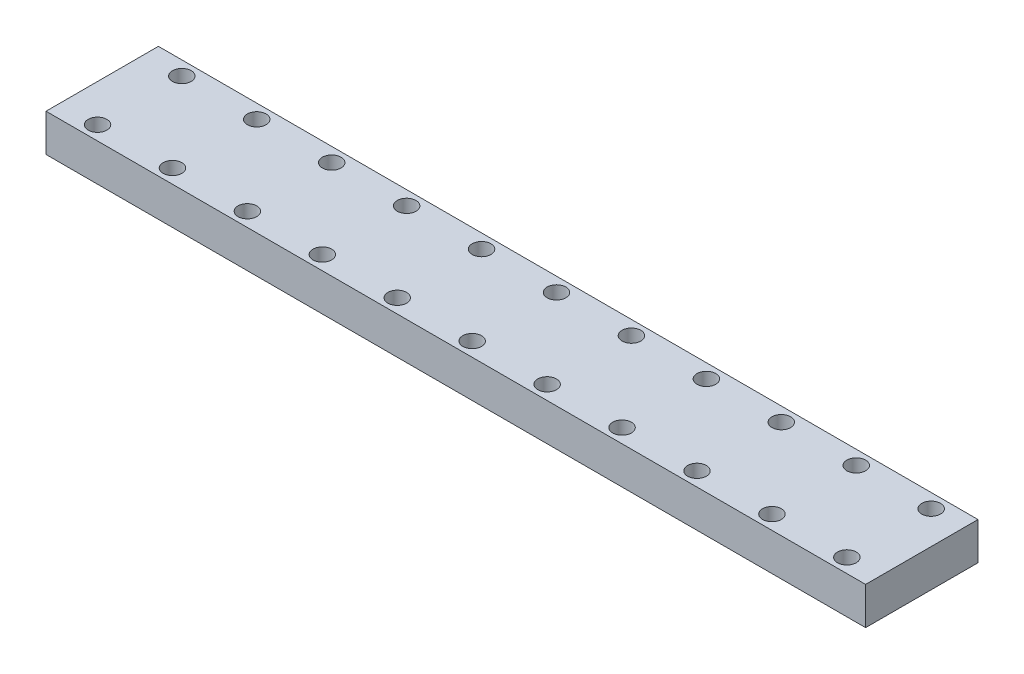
ISO-10303-21;
HEADER;
FILE_DESCRIPTION(('STEP AP214'),'2;1');
FILE_NAME('part.step','',(''),(''),'','','');
FILE_SCHEMA(('AUTOMOTIVE_DESIGN { 1 0 10303 214 1 1 1 1 }'));
ENDSEC;
DATA;
#1=APPLICATION_CONTEXT('core data for automotive mechanical design processes');
#2=APPLICATION_PROTOCOL_DEFINITION('international standard','automotive_design',2000,#1);
#3=PRODUCT_CONTEXT('',#1,'mechanical');
#4=PRODUCT('Part','Part','',(#3));
#5=PRODUCT_RELATED_PRODUCT_CATEGORY('part','',(#4));
#6=PRODUCT_DEFINITION_FORMATION('','',#4);
#7=PRODUCT_DEFINITION_CONTEXT('part definition',#1,'design');
#8=PRODUCT_DEFINITION('design','',#6,#7);
#9=PRODUCT_DEFINITION_SHAPE('','',#8);
#10=(LENGTH_UNIT() NAMED_UNIT(*) SI_UNIT(.MILLI.,.METRE.));
#11=(NAMED_UNIT(*) PLANE_ANGLE_UNIT() SI_UNIT($,.RADIAN.));
#12=(NAMED_UNIT(*) SI_UNIT($,.STERADIAN.) SOLID_ANGLE_UNIT());
#13=UNCERTAINTY_MEASURE_WITH_UNIT(LENGTH_MEASURE(1.E-05),#10,'distance_accuracy_value','');
#14=(GEOMETRIC_REPRESENTATION_CONTEXT(3) GLOBAL_UNCERTAINTY_ASSIGNED_CONTEXT((#13)) GLOBAL_UNIT_ASSIGNED_CONTEXT((#10,
#11,#12)) REPRESENTATION_CONTEXT('',''));
#15=CARTESIAN_POINT('',(0.,0.,0.));
#16=DIRECTION('',(0.,0.,1.));
#17=DIRECTION('',(1.,0.,0.));
#18=AXIS2_PLACEMENT_3D('',#15,#16,#17);
#19=CARTESIAN_POINT('',(0.,8.,0.));
#20=DIRECTION('',(0.,1.,0.));
#21=DIRECTION('',(0.,0.,1.));
#22=AXIS2_PLACEMENT_3D('',#19,#20,#21);
#23=PLANE('',#22);
#24=CARTESIAN_POINT('',(134.023529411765,8.,13.6117647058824));
#25=DIRECTION('',(0.,1.,0.));
#26=DIRECTION('',(0.,0.,1.));
#27=AXIS2_PLACEMENT_3D('',#24,#25,#26);
#28=CIRCLE('',#27,2.);
#29=CARTESIAN_POINT('',(134.023529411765,8.,15.6117647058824));
#30=VERTEX_POINT('',#29);
#31=EDGE_CURVE('E231',#30,#30,#28,.T.);
#32=ORIENTED_EDGE('',*,*,#31,.F.);
#33=EDGE_LOOP('',(#32));
#34=FACE_BOUND('',#33,.T.);
#35=CARTESIAN_POINT('',(102.023529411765,8.,13.6117647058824));
#36=DIRECTION('',(0.,1.,0.));
#37=DIRECTION('',(0.,0.,1.));
#38=AXIS2_PLACEMENT_3D('',#35,#36,#37);
#39=CIRCLE('',#38,2.);
#40=CARTESIAN_POINT('',(102.023529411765,8.,15.6117647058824));
#41=VERTEX_POINT('',#40);
#42=EDGE_CURVE('E219',#41,#41,#39,.T.);
#43=ORIENTED_EDGE('',*,*,#42,.F.);
#44=EDGE_LOOP('',(#43));
#45=FACE_BOUND('',#44,.T.);
#46=CARTESIAN_POINT('',(70.0235294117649,8.,13.6117647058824));
#47=DIRECTION('',(0.,1.,0.));
#48=DIRECTION('',(0.,0.,1.));
#49=AXIS2_PLACEMENT_3D('',#46,#47,#48);
#50=CIRCLE('',#49,2.);
#51=CARTESIAN_POINT('',(70.0235294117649,8.,15.6117647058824));
#52=VERTEX_POINT('',#51);
#53=EDGE_CURVE('E207',#52,#52,#50,.T.);
#54=ORIENTED_EDGE('',*,*,#53,.F.);
#55=EDGE_LOOP('',(#54));
#56=FACE_BOUND('',#55,.T.);
#57=CARTESIAN_POINT('',(38.0235294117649,8.,13.6117647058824));
#58=DIRECTION('',(0.,1.,0.));
#59=DIRECTION('',(0.,0.,1.));
#60=AXIS2_PLACEMENT_3D('',#57,#58,#59);
#61=CIRCLE('',#60,2.);
#62=CARTESIAN_POINT('',(38.0235294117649,8.,15.6117647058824));
#63=VERTEX_POINT('',#62);
#64=EDGE_CURVE('E195',#63,#63,#61,.T.);
#65=ORIENTED_EDGE('',*,*,#64,.F.);
#66=EDGE_LOOP('',(#65));
#67=FACE_BOUND('',#66,.T.);
#68=CARTESIAN_POINT('',(6.02352941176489,8.,13.6117647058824));
#69=DIRECTION('',(0.,1.,0.));
#70=DIRECTION('',(0.,0.,1.));
#71=AXIS2_PLACEMENT_3D('',#68,#69,#70);
#72=CIRCLE('',#71,2.);
#73=CARTESIAN_POINT('',(6.02352941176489,8.,15.6117647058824));
#74=VERTEX_POINT('',#73);
#75=EDGE_CURVE('E183',#74,#74,#72,.T.);
#76=ORIENTED_EDGE('',*,*,#75,.F.);
#77=EDGE_LOOP('',(#76));
#78=FACE_BOUND('',#77,.T.);
#79=CARTESIAN_POINT('',(150.023529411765,8.,-4.38823529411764));
#80=DIRECTION('',(0.,1.,0.));
#81=DIRECTION('',(0.,0.,1.));
#82=AXIS2_PLACEMENT_3D('',#79,#80,#81);
#83=CIRCLE('',#82,2.);
#84=CARTESIAN_POINT('',(150.023529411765,8.,-2.38823529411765));
#85=VERTEX_POINT('',#84);
#86=EDGE_CURVE('E171',#85,#85,#83,.T.);
#87=ORIENTED_EDGE('',*,*,#86,.F.);
#88=EDGE_LOOP('',(#87));
#89=FACE_BOUND('',#88,.T.);
#90=CARTESIAN_POINT('',(118.023529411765,8.,-4.38823529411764));
#91=DIRECTION('',(0.,1.,0.));
#92=DIRECTION('',(0.,0.,1.));
#93=AXIS2_PLACEMENT_3D('',#90,#91,#92);
#94=CIRCLE('',#93,2.);
#95=CARTESIAN_POINT('',(118.023529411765,8.,-2.38823529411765));
#96=VERTEX_POINT('',#95);
#97=EDGE_CURVE('E159',#96,#96,#94,.T.);
#98=ORIENTED_EDGE('',*,*,#97,.F.);
#99=EDGE_LOOP('',(#98));
#100=FACE_BOUND('',#99,.T.);
#101=CARTESIAN_POINT('',(86.0235294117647,8.,-4.38823529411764));
#102=DIRECTION('',(0.,1.,0.));
#103=DIRECTION('',(0.,0.,1.));
#104=AXIS2_PLACEMENT_3D('',#101,#102,#103);
#105=CIRCLE('',#104,2.00000000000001);
#106=CARTESIAN_POINT('',(86.0235294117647,8.,-2.38823529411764));
#107=VERTEX_POINT('',#106);
#108=EDGE_CURVE('E147',#107,#107,#105,.T.);
#109=ORIENTED_EDGE('',*,*,#108,.F.);
#110=EDGE_LOOP('',(#109));
#111=FACE_BOUND('',#110,.T.);
#112=CARTESIAN_POINT('',(54.0235294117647,8.,-4.38823529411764));
#113=DIRECTION('',(0.,1.,0.));
#114=DIRECTION('',(0.,0.,1.));
#115=AXIS2_PLACEMENT_3D('',#112,#113,#114);
#116=CIRCLE('',#115,2.);
#117=CARTESIAN_POINT('',(54.0235294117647,8.,-2.38823529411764));
#118=VERTEX_POINT('',#117);
#119=EDGE_CURVE('E135',#118,#118,#116,.T.);
#120=ORIENTED_EDGE('',*,*,#119,.F.);
#121=EDGE_LOOP('',(#120));
#122=FACE_BOUND('',#121,.T.);
#123=CARTESIAN_POINT('',(22.0235294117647,8.,-4.38823529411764));
#124=DIRECTION('',(0.,1.,0.));
#125=DIRECTION('',(0.,0.,1.));
#126=AXIS2_PLACEMENT_3D('',#123,#124,#125);
#127=CIRCLE('',#126,2.);
#128=CARTESIAN_POINT('',(22.0235294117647,8.,-2.38823529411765));
#129=VERTEX_POINT('',#128);
#130=EDGE_CURVE('E123',#129,#129,#127,.T.);
#131=ORIENTED_EDGE('',*,*,#130,.F.);
#132=EDGE_LOOP('',(#131));
#133=FACE_BOUND('',#132,.T.);
#134=CARTESIAN_POINT('',(-9.9764705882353,8.,-4.38823529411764));
#135=DIRECTION('',(0.,1.,0.));
#136=DIRECTION('',(0.,0.,1.));
#137=AXIS2_PLACEMENT_3D('',#134,#135,#136);
#138=CIRCLE('',#137,2.);
#139=CARTESIAN_POINT('',(-9.9764705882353,8.,-2.38823529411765));
#140=VERTEX_POINT('',#139);
#141=EDGE_CURVE('E102',#140,#140,#138,.T.);
#142=ORIENTED_EDGE('',*,*,#141,.F.);
#143=EDGE_LOOP('',(#142));
#144=FACE_BOUND('',#143,.T.);
#145=DIRECTION('',(0.,0.,1.));
#146=VECTOR('',#145,1.);
#147=CARTESIAN_POINT('',(-17.9764705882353,8.,-7.38823529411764));
#148=LINE('',#147,#146);
#149=CARTESIAN_POINT('',(-17.9764705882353,8.,-7.38823529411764));
#150=VERTEX_POINT('',#149);
#151=CARTESIAN_POINT('',(-17.9764705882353,8.,16.6117647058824));
#152=VERTEX_POINT('',#151);
#153=EDGE_CURVE('E87',#150,#152,#148,.T.);
#154=ORIENTED_EDGE('',*,*,#153,.T.);
#155=DIRECTION('',(1.,0.,0.));
#156=VECTOR('',#155,1.);
#157=CARTESIAN_POINT('',(-17.9764705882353,8.,16.6117647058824));
#158=LINE('',#157,#156);
#159=CARTESIAN_POINT('',(157.023529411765,8.,16.6117647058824));
#160=VERTEX_POINT('',#159);
#161=EDGE_CURVE('E82',#152,#160,#158,.T.);
#162=ORIENTED_EDGE('',*,*,#161,.T.);
#163=DIRECTION('',(0.,0.,-1.));
#164=VECTOR('',#163,1.);
#165=CARTESIAN_POINT('',(157.023529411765,8.,-7.38823529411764));
#166=LINE('',#165,#164);
#167=CARTESIAN_POINT('',(157.023529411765,8.,-7.38823529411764));
#168=VERTEX_POINT('',#167);
#169=EDGE_CURVE('E85',#160,#168,#166,.T.);
#170=ORIENTED_EDGE('',*,*,#169,.T.);
#171=DIRECTION('',(-1.,0.,0.));
#172=VECTOR('',#171,1.);
#173=CARTESIAN_POINT('',(-17.9764705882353,8.,-7.38823529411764));
#174=LINE('',#173,#172);
#175=EDGE_CURVE('E52',#168,#150,#174,.T.);
#176=ORIENTED_EDGE('',*,*,#175,.T.);
#177=EDGE_LOOP('',(#154,#162,#170,#176));
#178=FACE_BOUND('',#177,.T.);
#179=CARTESIAN_POINT('',(6.0235294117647,8.,-4.38823529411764));
#180=DIRECTION('',(0.,1.,0.));
#181=DIRECTION('',(0.,0.,1.));
#182=AXIS2_PLACEMENT_3D('',#179,#180,#181);
#183=CIRCLE('',#182,2.);
#184=CARTESIAN_POINT('',(6.0235294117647,8.,-2.38823529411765));
#185=VERTEX_POINT('',#184);
#186=EDGE_CURVE('E117',#185,#185,#183,.T.);
#187=ORIENTED_EDGE('',*,*,#186,.F.);
#188=EDGE_LOOP('',(#187));
#189=FACE_BOUND('',#188,.T.);
#190=CARTESIAN_POINT('',(38.0235294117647,8.,-4.38823529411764));
#191=DIRECTION('',(0.,1.,0.));
#192=DIRECTION('',(0.,0.,1.));
#193=AXIS2_PLACEMENT_3D('',#190,#191,#192);
#194=CIRCLE('',#193,2.);
#195=CARTESIAN_POINT('',(38.0235294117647,8.,-2.38823529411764));
#196=VERTEX_POINT('',#195);
#197=EDGE_CURVE('E129',#196,#196,#194,.T.);
#198=ORIENTED_EDGE('',*,*,#197,.F.);
#199=EDGE_LOOP('',(#198));
#200=FACE_BOUND('',#199,.T.);
#201=CARTESIAN_POINT('',(70.0235294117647,8.,-4.38823529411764));
#202=DIRECTION('',(0.,1.,0.));
#203=DIRECTION('',(0.,0.,1.));
#204=AXIS2_PLACEMENT_3D('',#201,#202,#203);
#205=CIRCLE('',#204,2.);
#206=CARTESIAN_POINT('',(70.0235294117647,8.,-2.38823529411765));
#207=VERTEX_POINT('',#206);
#208=EDGE_CURVE('E141',#207,#207,#205,.T.);
#209=ORIENTED_EDGE('',*,*,#208,.F.);
#210=EDGE_LOOP('',(#209));
#211=FACE_BOUND('',#210,.T.);
#212=CARTESIAN_POINT('',(102.023529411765,8.,-4.38823529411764));
#213=DIRECTION('',(0.,1.,0.));
#214=DIRECTION('',(0.,0.,1.));
#215=AXIS2_PLACEMENT_3D('',#212,#213,#214);
#216=CIRCLE('',#215,2.);
#217=CARTESIAN_POINT('',(102.023529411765,8.,-2.38823529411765));
#218=VERTEX_POINT('',#217);
#219=EDGE_CURVE('E153',#218,#218,#216,.T.);
#220=ORIENTED_EDGE('',*,*,#219,.F.);
#221=EDGE_LOOP('',(#220));
#222=FACE_BOUND('',#221,.T.);
#223=CARTESIAN_POINT('',(134.023529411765,8.,-4.38823529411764));
#224=DIRECTION('',(0.,1.,0.));
#225=DIRECTION('',(0.,0.,1.));
#226=AXIS2_PLACEMENT_3D('',#223,#224,#225);
#227=CIRCLE('',#226,2.);
#228=CARTESIAN_POINT('',(134.023529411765,8.,-2.38823529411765));
#229=VERTEX_POINT('',#228);
#230=EDGE_CURVE('E165',#229,#229,#227,.T.);
#231=ORIENTED_EDGE('',*,*,#230,.F.);
#232=EDGE_LOOP('',(#231));
#233=FACE_BOUND('',#232,.T.);
#234=CARTESIAN_POINT('',(-9.97647058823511,8.,13.6117647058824));
#235=DIRECTION('',(0.,1.,0.));
#236=DIRECTION('',(0.,0.,1.));
#237=AXIS2_PLACEMENT_3D('',#234,#235,#236);
#238=CIRCLE('',#237,2.);
#239=CARTESIAN_POINT('',(-9.97647058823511,8.,15.6117647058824));
#240=VERTEX_POINT('',#239);
#241=EDGE_CURVE('E177',#240,#240,#238,.T.);
#242=ORIENTED_EDGE('',*,*,#241,.F.);
#243=EDGE_LOOP('',(#242));
#244=FACE_BOUND('',#243,.T.);
#245=CARTESIAN_POINT('',(22.0235294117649,8.,13.6117647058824));
#246=DIRECTION('',(0.,1.,0.));
#247=DIRECTION('',(0.,0.,1.));
#248=AXIS2_PLACEMENT_3D('',#245,#246,#247);
#249=CIRCLE('',#248,2.);
#250=CARTESIAN_POINT('',(22.0235294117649,8.,15.6117647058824));
#251=VERTEX_POINT('',#250);
#252=EDGE_CURVE('E189',#251,#251,#249,.T.);
#253=ORIENTED_EDGE('',*,*,#252,.F.);
#254=EDGE_LOOP('',(#253));
#255=FACE_BOUND('',#254,.T.);
#256=CARTESIAN_POINT('',(54.0235294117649,8.,13.6117647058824));
#257=DIRECTION('',(0.,1.,0.));
#258=DIRECTION('',(0.,0.,1.));
#259=AXIS2_PLACEMENT_3D('',#256,#257,#258);
#260=CIRCLE('',#259,2.);
#261=CARTESIAN_POINT('',(54.0235294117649,8.,15.6117647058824));
#262=VERTEX_POINT('',#261);
#263=EDGE_CURVE('E201',#262,#262,#260,.T.);
#264=ORIENTED_EDGE('',*,*,#263,.F.);
#265=EDGE_LOOP('',(#264));
#266=FACE_BOUND('',#265,.T.);
#267=CARTESIAN_POINT('',(86.0235294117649,8.,13.6117647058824));
#268=DIRECTION('',(0.,1.,0.));
#269=DIRECTION('',(0.,0.,1.));
#270=AXIS2_PLACEMENT_3D('',#267,#268,#269);
#271=CIRCLE('',#270,2.00000000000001);
#272=CARTESIAN_POINT('',(86.0235294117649,8.,15.6117647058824));
#273=VERTEX_POINT('',#272);
#274=EDGE_CURVE('E213',#273,#273,#271,.T.);
#275=ORIENTED_EDGE('',*,*,#274,.F.);
#276=EDGE_LOOP('',(#275));
#277=FACE_BOUND('',#276,.T.);
#278=CARTESIAN_POINT('',(118.023529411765,8.,13.6117647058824));
#279=DIRECTION('',(0.,1.,0.));
#280=DIRECTION('',(0.,0.,1.));
#281=AXIS2_PLACEMENT_3D('',#278,#279,#280);
#282=CIRCLE('',#281,2.);
#283=CARTESIAN_POINT('',(118.023529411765,8.,15.6117647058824));
#284=VERTEX_POINT('',#283);
#285=EDGE_CURVE('E225',#284,#284,#282,.T.);
#286=ORIENTED_EDGE('',*,*,#285,.F.);
#287=EDGE_LOOP('',(#286));
#288=FACE_BOUND('',#287,.T.);
#289=CARTESIAN_POINT('',(150.023529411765,8.,13.6117647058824));
#290=DIRECTION('',(0.,1.,0.));
#291=DIRECTION('',(0.,0.,1.));
#292=AXIS2_PLACEMENT_3D('',#289,#290,#291);
#293=CIRCLE('',#292,2.);
#294=CARTESIAN_POINT('',(150.023529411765,8.,15.6117647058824));
#295=VERTEX_POINT('',#294);
#296=EDGE_CURVE('E237',#295,#295,#293,.T.);
#297=ORIENTED_EDGE('',*,*,#296,.F.);
#298=EDGE_LOOP('',(#297));
#299=FACE_BOUND('',#298,.T.);
#300=ADVANCED_FACE('F35',(#34,#45,#56,#67,#78,#89,#100,#111,#122,#133,#144,#178,#189,#200,#211,
#222,#233,#244,#255,#266,#277,#288,#299),#23,.T.);
#301=CARTESIAN_POINT('',(0.,0.,0.));
#302=DIRECTION('',(0.,1.,0.));
#303=DIRECTION('',(0.,0.,1.));
#304=AXIS2_PLACEMENT_3D('',#301,#302,#303);
#305=PLANE('',#304);
#306=DIRECTION('',(0.,0.,1.));
#307=VECTOR('',#306,1.);
#308=CARTESIAN_POINT('',(-17.9764705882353,0.,-7.38823529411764));
#309=LINE('',#308,#307);
#310=CARTESIAN_POINT('',(-17.9764705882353,0.,-7.38823529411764));
#311=VERTEX_POINT('',#310);
#312=CARTESIAN_POINT('',(-17.9764705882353,0.,16.6117647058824));
#313=VERTEX_POINT('',#312);
#314=EDGE_CURVE('E99',#311,#313,#309,.T.);
#315=ORIENTED_EDGE('',*,*,#314,.F.);
#316=DIRECTION('',(-1.,0.,0.));
#317=VECTOR('',#316,1.);
#318=CARTESIAN_POINT('',(-17.9764705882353,0.,-7.38823529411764));
#319=LINE('',#318,#317);
#320=CARTESIAN_POINT('',(157.023529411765,0.,-7.38823529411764));
#321=VERTEX_POINT('',#320);
#322=EDGE_CURVE('E75',#321,#311,#319,.T.);
#323=ORIENTED_EDGE('',*,*,#322,.F.);
#324=DIRECTION('',(0.,0.,-1.));
#325=VECTOR('',#324,1.);
#326=CARTESIAN_POINT('',(157.023529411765,0.,-7.38823529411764));
#327=LINE('',#326,#325);
#328=CARTESIAN_POINT('',(157.023529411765,0.,16.6117647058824));
#329=VERTEX_POINT('',#328);
#330=EDGE_CURVE('E69',#329,#321,#327,.T.);
#331=ORIENTED_EDGE('',*,*,#330,.F.);
#332=DIRECTION('',(1.,0.,0.));
#333=VECTOR('',#332,1.);
#334=CARTESIAN_POINT('',(-17.9764705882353,0.,16.6117647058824));
#335=LINE('',#334,#333);
#336=EDGE_CURVE('E91',#313,#329,#335,.T.);
#337=ORIENTED_EDGE('',*,*,#336,.F.);
#338=EDGE_LOOP('',(#315,#323,#331,#337));
#339=FACE_BOUND('',#338,.T.);
#340=CARTESIAN_POINT('',(-9.9764705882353,0.,-4.38823529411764));
#341=DIRECTION('',(0.,1.,0.));
#342=DIRECTION('',(0.,0.,1.));
#343=AXIS2_PLACEMENT_3D('',#340,#341,#342);
#344=CIRCLE('',#343,2.);
#345=CARTESIAN_POINT('',(-9.9764705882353,0.,-2.38823529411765));
#346=VERTEX_POINT('',#345);
#347=EDGE_CURVE('E114',#346,#346,#344,.T.);
#348=ORIENTED_EDGE('',*,*,#347,.T.);
#349=EDGE_LOOP('',(#348));
#350=FACE_BOUND('',#349,.T.);
#351=CARTESIAN_POINT('',(6.0235294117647,0.,-4.38823529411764));
#352=DIRECTION('',(0.,1.,0.));
#353=DIRECTION('',(0.,0.,1.));
#354=AXIS2_PLACEMENT_3D('',#351,#352,#353);
#355=CIRCLE('',#354,2.);
#356=CARTESIAN_POINT('',(6.0235294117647,0.,-2.38823529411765));
#357=VERTEX_POINT('',#356);
#358=EDGE_CURVE('E120',#357,#357,#355,.T.);
#359=ORIENTED_EDGE('',*,*,#358,.T.);
#360=EDGE_LOOP('',(#359));
#361=FACE_BOUND('',#360,.T.);
#362=CARTESIAN_POINT('',(22.0235294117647,0.,-4.38823529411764));
#363=DIRECTION('',(0.,1.,0.));
#364=DIRECTION('',(0.,0.,1.));
#365=AXIS2_PLACEMENT_3D('',#362,#363,#364);
#366=CIRCLE('',#365,2.);
#367=CARTESIAN_POINT('',(22.0235294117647,0.,-2.38823529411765));
#368=VERTEX_POINT('',#367);
#369=EDGE_CURVE('E126',#368,#368,#366,.T.);
#370=ORIENTED_EDGE('',*,*,#369,.T.);
#371=EDGE_LOOP('',(#370));
#372=FACE_BOUND('',#371,.T.);
#373=CARTESIAN_POINT('',(38.0235294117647,0.,-4.38823529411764));
#374=DIRECTION('',(0.,1.,0.));
#375=DIRECTION('',(0.,0.,1.));
#376=AXIS2_PLACEMENT_3D('',#373,#374,#375);
#377=CIRCLE('',#376,2.);
#378=CARTESIAN_POINT('',(38.0235294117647,0.,-2.38823529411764));
#379=VERTEX_POINT('',#378);
#380=EDGE_CURVE('E132',#379,#379,#377,.T.);
#381=ORIENTED_EDGE('',*,*,#380,.T.);
#382=EDGE_LOOP('',(#381));
#383=FACE_BOUND('',#382,.T.);
#384=CARTESIAN_POINT('',(54.0235294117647,0.,-4.38823529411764));
#385=DIRECTION('',(0.,1.,0.));
#386=DIRECTION('',(0.,0.,1.));
#387=AXIS2_PLACEMENT_3D('',#384,#385,#386);
#388=CIRCLE('',#387,2.);
#389=CARTESIAN_POINT('',(54.0235294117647,0.,-2.38823529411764));
#390=VERTEX_POINT('',#389);
#391=EDGE_CURVE('E138',#390,#390,#388,.T.);
#392=ORIENTED_EDGE('',*,*,#391,.T.);
#393=EDGE_LOOP('',(#392));
#394=FACE_BOUND('',#393,.T.);
#395=CARTESIAN_POINT('',(70.0235294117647,0.,-4.38823529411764));
#396=DIRECTION('',(0.,1.,0.));
#397=DIRECTION('',(0.,0.,1.));
#398=AXIS2_PLACEMENT_3D('',#395,#396,#397);
#399=CIRCLE('',#398,2.);
#400=CARTESIAN_POINT('',(70.0235294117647,0.,-2.38823529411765));
#401=VERTEX_POINT('',#400);
#402=EDGE_CURVE('E144',#401,#401,#399,.T.);
#403=ORIENTED_EDGE('',*,*,#402,.T.);
#404=EDGE_LOOP('',(#403));
#405=FACE_BOUND('',#404,.T.);
#406=CARTESIAN_POINT('',(86.0235294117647,0.,-4.38823529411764));
#407=DIRECTION('',(0.,1.,0.));
#408=DIRECTION('',(0.,0.,1.));
#409=AXIS2_PLACEMENT_3D('',#406,#407,#408);
#410=CIRCLE('',#409,2.00000000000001);
#411=CARTESIAN_POINT('',(86.0235294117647,0.,-2.38823529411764));
#412=VERTEX_POINT('',#411);
#413=EDGE_CURVE('E150',#412,#412,#410,.T.);
#414=ORIENTED_EDGE('',*,*,#413,.T.);
#415=EDGE_LOOP('',(#414));
#416=FACE_BOUND('',#415,.T.);
#417=CARTESIAN_POINT('',(102.023529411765,0.,-4.38823529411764));
#418=DIRECTION('',(0.,1.,0.));
#419=DIRECTION('',(0.,0.,1.));
#420=AXIS2_PLACEMENT_3D('',#417,#418,#419);
#421=CIRCLE('',#420,2.);
#422=CARTESIAN_POINT('',(102.023529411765,0.,-2.38823529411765));
#423=VERTEX_POINT('',#422);
#424=EDGE_CURVE('E156',#423,#423,#421,.T.);
#425=ORIENTED_EDGE('',*,*,#424,.T.);
#426=EDGE_LOOP('',(#425));
#427=FACE_BOUND('',#426,.T.);
#428=CARTESIAN_POINT('',(118.023529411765,0.,-4.38823529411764));
#429=DIRECTION('',(0.,1.,0.));
#430=DIRECTION('',(0.,0.,1.));
#431=AXIS2_PLACEMENT_3D('',#428,#429,#430);
#432=CIRCLE('',#431,2.);
#433=CARTESIAN_POINT('',(118.023529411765,0.,-2.38823529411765));
#434=VERTEX_POINT('',#433);
#435=EDGE_CURVE('E162',#434,#434,#432,.T.);
#436=ORIENTED_EDGE('',*,*,#435,.T.);
#437=EDGE_LOOP('',(#436));
#438=FACE_BOUND('',#437,.T.);
#439=CARTESIAN_POINT('',(134.023529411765,0.,-4.38823529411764));
#440=DIRECTION('',(0.,1.,0.));
#441=DIRECTION('',(0.,0.,1.));
#442=AXIS2_PLACEMENT_3D('',#439,#440,#441);
#443=CIRCLE('',#442,2.);
#444=CARTESIAN_POINT('',(134.023529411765,0.,-2.38823529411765));
#445=VERTEX_POINT('',#444);
#446=EDGE_CURVE('E168',#445,#445,#443,.T.);
#447=ORIENTED_EDGE('',*,*,#446,.T.);
#448=EDGE_LOOP('',(#447));
#449=FACE_BOUND('',#448,.T.);
#450=CARTESIAN_POINT('',(150.023529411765,0.,-4.38823529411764));
#451=DIRECTION('',(0.,1.,0.));
#452=DIRECTION('',(0.,0.,1.));
#453=AXIS2_PLACEMENT_3D('',#450,#451,#452);
#454=CIRCLE('',#453,2.);
#455=CARTESIAN_POINT('',(150.023529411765,0.,-2.38823529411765));
#456=VERTEX_POINT('',#455);
#457=EDGE_CURVE('E174',#456,#456,#454,.T.);
#458=ORIENTED_EDGE('',*,*,#457,.T.);
#459=EDGE_LOOP('',(#458));
#460=FACE_BOUND('',#459,.T.);
#461=CARTESIAN_POINT('',(-9.97647058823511,0.,13.6117647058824));
#462=DIRECTION('',(0.,1.,0.));
#463=DIRECTION('',(0.,0.,1.));
#464=AXIS2_PLACEMENT_3D('',#461,#462,#463);
#465=CIRCLE('',#464,2.);
#466=CARTESIAN_POINT('',(-9.97647058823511,0.,15.6117647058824));
#467=VERTEX_POINT('',#466);
#468=EDGE_CURVE('E180',#467,#467,#465,.T.);
#469=ORIENTED_EDGE('',*,*,#468,.T.);
#470=EDGE_LOOP('',(#469));
#471=FACE_BOUND('',#470,.T.);
#472=CARTESIAN_POINT('',(6.02352941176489,0.,13.6117647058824));
#473=DIRECTION('',(0.,1.,0.));
#474=DIRECTION('',(0.,0.,1.));
#475=AXIS2_PLACEMENT_3D('',#472,#473,#474);
#476=CIRCLE('',#475,2.);
#477=CARTESIAN_POINT('',(6.02352941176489,0.,15.6117647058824));
#478=VERTEX_POINT('',#477);
#479=EDGE_CURVE('E186',#478,#478,#476,.T.);
#480=ORIENTED_EDGE('',*,*,#479,.T.);
#481=EDGE_LOOP('',(#480));
#482=FACE_BOUND('',#481,.T.);
#483=CARTESIAN_POINT('',(22.0235294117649,0.,13.6117647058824));
#484=DIRECTION('',(0.,1.,0.));
#485=DIRECTION('',(0.,0.,1.));
#486=AXIS2_PLACEMENT_3D('',#483,#484,#485);
#487=CIRCLE('',#486,2.);
#488=CARTESIAN_POINT('',(22.0235294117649,0.,15.6117647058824));
#489=VERTEX_POINT('',#488);
#490=EDGE_CURVE('E192',#489,#489,#487,.T.);
#491=ORIENTED_EDGE('',*,*,#490,.T.);
#492=EDGE_LOOP('',(#491));
#493=FACE_BOUND('',#492,.T.);
#494=CARTESIAN_POINT('',(38.0235294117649,0.,13.6117647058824));
#495=DIRECTION('',(0.,1.,0.));
#496=DIRECTION('',(0.,0.,1.));
#497=AXIS2_PLACEMENT_3D('',#494,#495,#496);
#498=CIRCLE('',#497,2.);
#499=CARTESIAN_POINT('',(38.0235294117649,0.,15.6117647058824));
#500=VERTEX_POINT('',#499);
#501=EDGE_CURVE('E198',#500,#500,#498,.T.);
#502=ORIENTED_EDGE('',*,*,#501,.T.);
#503=EDGE_LOOP('',(#502));
#504=FACE_BOUND('',#503,.T.);
#505=CARTESIAN_POINT('',(54.0235294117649,0.,13.6117647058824));
#506=DIRECTION('',(0.,1.,0.));
#507=DIRECTION('',(0.,0.,1.));
#508=AXIS2_PLACEMENT_3D('',#505,#506,#507);
#509=CIRCLE('',#508,2.);
#510=CARTESIAN_POINT('',(54.0235294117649,0.,15.6117647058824));
#511=VERTEX_POINT('',#510);
#512=EDGE_CURVE('E204',#511,#511,#509,.T.);
#513=ORIENTED_EDGE('',*,*,#512,.T.);
#514=EDGE_LOOP('',(#513));
#515=FACE_BOUND('',#514,.T.);
#516=CARTESIAN_POINT('',(70.0235294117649,0.,13.6117647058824));
#517=DIRECTION('',(0.,1.,0.));
#518=DIRECTION('',(0.,0.,1.));
#519=AXIS2_PLACEMENT_3D('',#516,#517,#518);
#520=CIRCLE('',#519,2.);
#521=CARTESIAN_POINT('',(70.0235294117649,0.,15.6117647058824));
#522=VERTEX_POINT('',#521);
#523=EDGE_CURVE('E210',#522,#522,#520,.T.);
#524=ORIENTED_EDGE('',*,*,#523,.T.);
#525=EDGE_LOOP('',(#524));
#526=FACE_BOUND('',#525,.T.);
#527=CARTESIAN_POINT('',(86.0235294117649,0.,13.6117647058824));
#528=DIRECTION('',(0.,1.,0.));
#529=DIRECTION('',(0.,0.,1.));
#530=AXIS2_PLACEMENT_3D('',#527,#528,#529);
#531=CIRCLE('',#530,2.00000000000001);
#532=CARTESIAN_POINT('',(86.0235294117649,0.,15.6117647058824));
#533=VERTEX_POINT('',#532);
#534=EDGE_CURVE('E216',#533,#533,#531,.T.);
#535=ORIENTED_EDGE('',*,*,#534,.T.);
#536=EDGE_LOOP('',(#535));
#537=FACE_BOUND('',#536,.T.);
#538=CARTESIAN_POINT('',(102.023529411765,0.,13.6117647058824));
#539=DIRECTION('',(0.,1.,0.));
#540=DIRECTION('',(0.,0.,1.));
#541=AXIS2_PLACEMENT_3D('',#538,#539,#540);
#542=CIRCLE('',#541,2.);
#543=CARTESIAN_POINT('',(102.023529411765,0.,15.6117647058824));
#544=VERTEX_POINT('',#543);
#545=EDGE_CURVE('E222',#544,#544,#542,.T.);
#546=ORIENTED_EDGE('',*,*,#545,.T.);
#547=EDGE_LOOP('',(#546));
#548=FACE_BOUND('',#547,.T.);
#549=CARTESIAN_POINT('',(118.023529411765,0.,13.6117647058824));
#550=DIRECTION('',(0.,1.,0.));
#551=DIRECTION('',(0.,0.,1.));
#552=AXIS2_PLACEMENT_3D('',#549,#550,#551);
#553=CIRCLE('',#552,2.);
#554=CARTESIAN_POINT('',(118.023529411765,0.,15.6117647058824));
#555=VERTEX_POINT('',#554);
#556=EDGE_CURVE('E228',#555,#555,#553,.T.);
#557=ORIENTED_EDGE('',*,*,#556,.T.);
#558=EDGE_LOOP('',(#557));
#559=FACE_BOUND('',#558,.T.);
#560=CARTESIAN_POINT('',(134.023529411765,0.,13.6117647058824));
#561=DIRECTION('',(0.,1.,0.));
#562=DIRECTION('',(0.,0.,1.));
#563=AXIS2_PLACEMENT_3D('',#560,#561,#562);
#564=CIRCLE('',#563,2.);
#565=CARTESIAN_POINT('',(134.023529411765,0.,15.6117647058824));
#566=VERTEX_POINT('',#565);
#567=EDGE_CURVE('E234',#566,#566,#564,.T.);
#568=ORIENTED_EDGE('',*,*,#567,.T.);
#569=EDGE_LOOP('',(#568));
#570=FACE_BOUND('',#569,.T.);
#571=CARTESIAN_POINT('',(150.023529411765,0.,13.6117647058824));
#572=DIRECTION('',(0.,1.,0.));
#573=DIRECTION('',(0.,0.,1.));
#574=AXIS2_PLACEMENT_3D('',#571,#572,#573);
#575=CIRCLE('',#574,2.);
#576=CARTESIAN_POINT('',(150.023529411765,0.,15.6117647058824));
#577=VERTEX_POINT('',#576);
#578=EDGE_CURVE('E240',#577,#577,#575,.T.);
#579=ORIENTED_EDGE('',*,*,#578,.T.);
#580=EDGE_LOOP('',(#579));
#581=FACE_BOUND('',#580,.T.);
#582=ADVANCED_FACE('F110',(#339,#350,#361,#372,#383,#394,#405,#416,#427,#438,#449,#460,#471,
#482,#493,#504,#515,#526,#537,#548,#559,#570,#581),#305,.F.);
#583=CARTESIAN_POINT('',(-17.9764705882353,8.,-7.38823529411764));
#584=DIRECTION('',(1.,0.,0.));
#585=DIRECTION('',(0.,0.,-1.));
#586=AXIS2_PLACEMENT_3D('',#583,#584,#585);
#587=PLANE('',#586);
#588=ORIENTED_EDGE('',*,*,#314,.T.);
#589=DIRECTION('',(0.,-1.,0.));
#590=VECTOR('',#589,1.);
#591=CARTESIAN_POINT('',(-17.9764705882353,8.,16.6117647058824));
#592=LINE('',#591,#590);
#593=EDGE_CURVE('E11',#152,#313,#592,.T.);
#594=ORIENTED_EDGE('',*,*,#593,.F.);
#595=ORIENTED_EDGE('',*,*,#153,.F.);
#596=DIRECTION('',(0.,-1.,0.));
#597=VECTOR('',#596,1.);
#598=CARTESIAN_POINT('',(-17.9764705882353,8.,-7.38823529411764));
#599=LINE('',#598,#597);
#600=EDGE_CURVE('E95',#150,#311,#599,.T.);
#601=ORIENTED_EDGE('',*,*,#600,.T.);
#602=EDGE_LOOP('',(#588,#594,#595,#601));
#603=FACE_BOUND('',#602,.T.);
#604=ADVANCED_FACE('F37',(#603),#587,.F.);
#605=CARTESIAN_POINT('',(-17.9764705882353,8.,16.6117647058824));
#606=DIRECTION('',(0.,0.,-1.));
#607=DIRECTION('',(-1.,0.,0.));
#608=AXIS2_PLACEMENT_3D('',#605,#606,#607);
#609=PLANE('',#608);
#610=ORIENTED_EDGE('',*,*,#336,.T.);
#611=DIRECTION('',(0.,-1.,0.));
#612=VECTOR('',#611,1.);
#613=CARTESIAN_POINT('',(157.023529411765,8.,16.6117647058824));
#614=LINE('',#613,#612);
#615=EDGE_CURVE('E44',#160,#329,#614,.T.);
#616=ORIENTED_EDGE('',*,*,#615,.F.);
#617=ORIENTED_EDGE('',*,*,#161,.F.);
#618=ORIENTED_EDGE('',*,*,#593,.T.);
#619=EDGE_LOOP('',(#610,#616,#617,#618));
#620=FACE_BOUND('',#619,.T.);
#621=ADVANCED_FACE('F90',(#620),#609,.F.);
#622=CARTESIAN_POINT('',(157.023529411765,8.,-7.38823529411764));
#623=DIRECTION('',(-1.,0.,0.));
#624=DIRECTION('',(0.,0.,1.));
#625=AXIS2_PLACEMENT_3D('',#622,#623,#624);
#626=PLANE('',#625);
#627=ORIENTED_EDGE('',*,*,#330,.T.);
#628=DIRECTION('',(0.,-1.,0.));
#629=VECTOR('',#628,1.);
#630=CARTESIAN_POINT('',(157.023529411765,8.,-7.38823529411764));
#631=LINE('',#630,#629);
#632=EDGE_CURVE('E92',#168,#321,#631,.T.);
#633=ORIENTED_EDGE('',*,*,#632,.F.);
#634=ORIENTED_EDGE('',*,*,#169,.F.);
#635=ORIENTED_EDGE('',*,*,#615,.T.);
#636=EDGE_LOOP('',(#627,#633,#634,#635));
#637=FACE_BOUND('',#636,.T.);
#638=ADVANCED_FACE('F93',(#637),#626,.F.);
#639=CARTESIAN_POINT('',(-17.9764705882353,8.,-7.38823529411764));
#640=DIRECTION('',(0.,0.,1.));
#641=DIRECTION('',(1.,0.,0.));
#642=AXIS2_PLACEMENT_3D('',#639,#640,#641);
#643=PLANE('',#642);
#644=ORIENTED_EDGE('',*,*,#322,.T.);
#645=ORIENTED_EDGE('',*,*,#600,.F.);
#646=ORIENTED_EDGE('',*,*,#175,.F.);
#647=ORIENTED_EDGE('',*,*,#632,.T.);
#648=EDGE_LOOP('',(#644,#645,#646,#647));
#649=FACE_BOUND('',#648,.T.);
#650=ADVANCED_FACE('F107',(#649),#643,.F.);
#651=CARTESIAN_POINT('',(-9.9764705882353,8.,-4.38823529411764));
#652=DIRECTION('',(0.,-1.,0.));
#653=DIRECTION('',(0.,0.,-1.));
#654=AXIS2_PLACEMENT_3D('',#651,#652,#653);
#655=CYLINDRICAL_SURFACE('',#654,2.);
#656=ORIENTED_EDGE('',*,*,#141,.T.);
#657=EDGE_LOOP('',(#656));
#658=FACE_BOUND('',#657,.T.);
#659=ORIENTED_EDGE('',*,*,#347,.F.);
#660=EDGE_LOOP('',(#659));
#661=FACE_BOUND('',#660,.T.);
#662=ADVANCED_FACE('F259',(#658,#661),#655,.F.);
#663=CARTESIAN_POINT('',(6.0235294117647,8.,-4.38823529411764));
#664=DIRECTION('',(0.,-1.,0.));
#665=DIRECTION('',(0.,0.,-1.));
#666=AXIS2_PLACEMENT_3D('',#663,#664,#665);
#667=CYLINDRICAL_SURFACE('',#666,2.);
#668=ORIENTED_EDGE('',*,*,#186,.T.);
#669=EDGE_LOOP('',(#668));
#670=FACE_BOUND('',#669,.T.);
#671=ORIENTED_EDGE('',*,*,#358,.F.);
#672=EDGE_LOOP('',(#671));
#673=FACE_BOUND('',#672,.T.);
#674=ADVANCED_FACE('F305',(#670,#673),#667,.F.);
#675=CARTESIAN_POINT('',(22.0235294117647,8.,-4.38823529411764));
#676=DIRECTION('',(0.,-1.,0.));
#677=DIRECTION('',(0.,0.,-1.));
#678=AXIS2_PLACEMENT_3D('',#675,#676,#677);
#679=CYLINDRICAL_SURFACE('',#678,2.);
#680=ORIENTED_EDGE('',*,*,#130,.T.);
#681=EDGE_LOOP('',(#680));
#682=FACE_BOUND('',#681,.T.);
#683=ORIENTED_EDGE('',*,*,#369,.F.);
#684=EDGE_LOOP('',(#683));
#685=FACE_BOUND('',#684,.T.);
#686=ADVANCED_FACE('F313',(#682,#685),#679,.F.);
#687=CARTESIAN_POINT('',(38.0235294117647,8.,-4.38823529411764));
#688=DIRECTION('',(0.,-1.,0.));
#689=DIRECTION('',(0.,0.,-1.));
#690=AXIS2_PLACEMENT_3D('',#687,#688,#689);
#691=CYLINDRICAL_SURFACE('',#690,2.);
#692=ORIENTED_EDGE('',*,*,#197,.T.);
#693=EDGE_LOOP('',(#692));
#694=FACE_BOUND('',#693,.T.);
#695=ORIENTED_EDGE('',*,*,#380,.F.);
#696=EDGE_LOOP('',(#695));
#697=FACE_BOUND('',#696,.T.);
#698=ADVANCED_FACE('F321',(#694,#697),#691,.F.);
#699=CARTESIAN_POINT('',(54.0235294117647,8.,-4.38823529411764));
#700=DIRECTION('',(0.,-1.,0.));
#701=DIRECTION('',(0.,0.,-1.));
#702=AXIS2_PLACEMENT_3D('',#699,#700,#701);
#703=CYLINDRICAL_SURFACE('',#702,2.);
#704=ORIENTED_EDGE('',*,*,#119,.T.);
#705=EDGE_LOOP('',(#704));
#706=FACE_BOUND('',#705,.T.);
#707=ORIENTED_EDGE('',*,*,#391,.F.);
#708=EDGE_LOOP('',(#707));
#709=FACE_BOUND('',#708,.T.);
#710=ADVANCED_FACE('F330',(#706,#709),#703,.F.);
#711=CARTESIAN_POINT('',(70.0235294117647,8.,-4.38823529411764));
#712=DIRECTION('',(0.,-1.,0.));
#713=DIRECTION('',(0.,0.,-1.));
#714=AXIS2_PLACEMENT_3D('',#711,#712,#713);
#715=CYLINDRICAL_SURFACE('',#714,2.);
#716=ORIENTED_EDGE('',*,*,#208,.T.);
#717=EDGE_LOOP('',(#716));
#718=FACE_BOUND('',#717,.T.);
#719=ORIENTED_EDGE('',*,*,#402,.F.);
#720=EDGE_LOOP('',(#719));
#721=FACE_BOUND('',#720,.T.);
#722=ADVANCED_FACE('F339',(#718,#721),#715,.F.);
#723=CARTESIAN_POINT('',(86.0235294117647,8.,-4.38823529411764));
#724=DIRECTION('',(0.,-1.,0.));
#725=DIRECTION('',(0.,0.,-1.));
#726=AXIS2_PLACEMENT_3D('',#723,#724,#725);
#727=CYLINDRICAL_SURFACE('',#726,2.00000000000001);
#728=ORIENTED_EDGE('',*,*,#108,.T.);
#729=EDGE_LOOP('',(#728));
#730=FACE_BOUND('',#729,.T.);
#731=ORIENTED_EDGE('',*,*,#413,.F.);
#732=EDGE_LOOP('',(#731));
#733=FACE_BOUND('',#732,.T.);
#734=ADVANCED_FACE('F348',(#730,#733),#727,.F.);
#735=CARTESIAN_POINT('',(102.023529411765,8.,-4.38823529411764));
#736=DIRECTION('',(0.,-1.,0.));
#737=DIRECTION('',(0.,0.,-1.));
#738=AXIS2_PLACEMENT_3D('',#735,#736,#737);
#739=CYLINDRICAL_SURFACE('',#738,2.);
#740=ORIENTED_EDGE('',*,*,#219,.T.);
#741=EDGE_LOOP('',(#740));
#742=FACE_BOUND('',#741,.T.);
#743=ORIENTED_EDGE('',*,*,#424,.F.);
#744=EDGE_LOOP('',(#743));
#745=FACE_BOUND('',#744,.T.);
#746=ADVANCED_FACE('F357',(#742,#745),#739,.F.);
#747=CARTESIAN_POINT('',(118.023529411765,8.,-4.38823529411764));
#748=DIRECTION('',(0.,-1.,0.));
#749=DIRECTION('',(0.,0.,-1.));
#750=AXIS2_PLACEMENT_3D('',#747,#748,#749);
#751=CYLINDRICAL_SURFACE('',#750,2.);
#752=ORIENTED_EDGE('',*,*,#97,.T.);
#753=EDGE_LOOP('',(#752));
#754=FACE_BOUND('',#753,.T.);
#755=ORIENTED_EDGE('',*,*,#435,.F.);
#756=EDGE_LOOP('',(#755));
#757=FACE_BOUND('',#756,.T.);
#758=ADVANCED_FACE('F366',(#754,#757),#751,.F.);
#759=CARTESIAN_POINT('',(134.023529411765,8.,-4.38823529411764));
#760=DIRECTION('',(0.,-1.,0.));
#761=DIRECTION('',(0.,0.,-1.));
#762=AXIS2_PLACEMENT_3D('',#759,#760,#761);
#763=CYLINDRICAL_SURFACE('',#762,2.);
#764=ORIENTED_EDGE('',*,*,#230,.T.);
#765=EDGE_LOOP('',(#764));
#766=FACE_BOUND('',#765,.T.);
#767=ORIENTED_EDGE('',*,*,#446,.F.);
#768=EDGE_LOOP('',(#767));
#769=FACE_BOUND('',#768,.T.);
#770=ADVANCED_FACE('F375',(#766,#769),#763,.F.);
#771=CARTESIAN_POINT('',(150.023529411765,8.,-4.38823529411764));
#772=DIRECTION('',(0.,-1.,0.));
#773=DIRECTION('',(0.,0.,-1.));
#774=AXIS2_PLACEMENT_3D('',#771,#772,#773);
#775=CYLINDRICAL_SURFACE('',#774,2.);
#776=ORIENTED_EDGE('',*,*,#86,.T.);
#777=EDGE_LOOP('',(#776));
#778=FACE_BOUND('',#777,.T.);
#779=ORIENTED_EDGE('',*,*,#457,.F.);
#780=EDGE_LOOP('',(#779));
#781=FACE_BOUND('',#780,.T.);
#782=ADVANCED_FACE('F384',(#778,#781),#775,.F.);
#783=CARTESIAN_POINT('',(-9.97647058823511,8.,13.6117647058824));
#784=DIRECTION('',(0.,-1.,0.));
#785=DIRECTION('',(0.,0.,-1.));
#786=AXIS2_PLACEMENT_3D('',#783,#784,#785);
#787=CYLINDRICAL_SURFACE('',#786,2.);
#788=ORIENTED_EDGE('',*,*,#241,.T.);
#789=EDGE_LOOP('',(#788));
#790=FACE_BOUND('',#789,.T.);
#791=ORIENTED_EDGE('',*,*,#468,.F.);
#792=EDGE_LOOP('',(#791));
#793=FACE_BOUND('',#792,.T.);
#794=ADVANCED_FACE('F393',(#790,#793),#787,.F.);
#795=CARTESIAN_POINT('',(6.02352941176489,8.,13.6117647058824));
#796=DIRECTION('',(0.,-1.,0.));
#797=DIRECTION('',(0.,0.,-1.));
#798=AXIS2_PLACEMENT_3D('',#795,#796,#797);
#799=CYLINDRICAL_SURFACE('',#798,2.);
#800=ORIENTED_EDGE('',*,*,#75,.T.);
#801=EDGE_LOOP('',(#800));
#802=FACE_BOUND('',#801,.T.);
#803=ORIENTED_EDGE('',*,*,#479,.F.);
#804=EDGE_LOOP('',(#803));
#805=FACE_BOUND('',#804,.T.);
#806=ADVANCED_FACE('F402',(#802,#805),#799,.F.);
#807=CARTESIAN_POINT('',(22.0235294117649,8.,13.6117647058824));
#808=DIRECTION('',(0.,-1.,0.));
#809=DIRECTION('',(0.,0.,-1.));
#810=AXIS2_PLACEMENT_3D('',#807,#808,#809);
#811=CYLINDRICAL_SURFACE('',#810,2.);
#812=ORIENTED_EDGE('',*,*,#252,.T.);
#813=EDGE_LOOP('',(#812));
#814=FACE_BOUND('',#813,.T.);
#815=ORIENTED_EDGE('',*,*,#490,.F.);
#816=EDGE_LOOP('',(#815));
#817=FACE_BOUND('',#816,.T.);
#818=ADVANCED_FACE('F411',(#814,#817),#811,.F.);
#819=CARTESIAN_POINT('',(38.0235294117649,8.,13.6117647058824));
#820=DIRECTION('',(0.,-1.,0.));
#821=DIRECTION('',(0.,0.,-1.));
#822=AXIS2_PLACEMENT_3D('',#819,#820,#821);
#823=CYLINDRICAL_SURFACE('',#822,2.);
#824=ORIENTED_EDGE('',*,*,#64,.T.);
#825=EDGE_LOOP('',(#824));
#826=FACE_BOUND('',#825,.T.);
#827=ORIENTED_EDGE('',*,*,#501,.F.);
#828=EDGE_LOOP('',(#827));
#829=FACE_BOUND('',#828,.T.);
#830=ADVANCED_FACE('F420',(#826,#829),#823,.F.);
#831=CARTESIAN_POINT('',(54.0235294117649,8.,13.6117647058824));
#832=DIRECTION('',(0.,-1.,0.));
#833=DIRECTION('',(0.,0.,-1.));
#834=AXIS2_PLACEMENT_3D('',#831,#832,#833);
#835=CYLINDRICAL_SURFACE('',#834,2.);
#836=ORIENTED_EDGE('',*,*,#263,.T.);
#837=EDGE_LOOP('',(#836));
#838=FACE_BOUND('',#837,.T.);
#839=ORIENTED_EDGE('',*,*,#512,.F.);
#840=EDGE_LOOP('',(#839));
#841=FACE_BOUND('',#840,.T.);
#842=ADVANCED_FACE('F429',(#838,#841),#835,.F.);
#843=CARTESIAN_POINT('',(70.0235294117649,8.,13.6117647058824));
#844=DIRECTION('',(0.,-1.,0.));
#845=DIRECTION('',(0.,0.,-1.));
#846=AXIS2_PLACEMENT_3D('',#843,#844,#845);
#847=CYLINDRICAL_SURFACE('',#846,2.);
#848=ORIENTED_EDGE('',*,*,#53,.T.);
#849=EDGE_LOOP('',(#848));
#850=FACE_BOUND('',#849,.T.);
#851=ORIENTED_EDGE('',*,*,#523,.F.);
#852=EDGE_LOOP('',(#851));
#853=FACE_BOUND('',#852,.T.);
#854=ADVANCED_FACE('F438',(#850,#853),#847,.F.);
#855=CARTESIAN_POINT('',(86.0235294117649,8.,13.6117647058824));
#856=DIRECTION('',(0.,-1.,0.));
#857=DIRECTION('',(0.,0.,-1.));
#858=AXIS2_PLACEMENT_3D('',#855,#856,#857);
#859=CYLINDRICAL_SURFACE('',#858,2.00000000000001);
#860=ORIENTED_EDGE('',*,*,#274,.T.);
#861=EDGE_LOOP('',(#860));
#862=FACE_BOUND('',#861,.T.);
#863=ORIENTED_EDGE('',*,*,#534,.F.);
#864=EDGE_LOOP('',(#863));
#865=FACE_BOUND('',#864,.T.);
#866=ADVANCED_FACE('F447',(#862,#865),#859,.F.);
#867=CARTESIAN_POINT('',(102.023529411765,8.,13.6117647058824));
#868=DIRECTION('',(0.,-1.,0.));
#869=DIRECTION('',(0.,0.,-1.));
#870=AXIS2_PLACEMENT_3D('',#867,#868,#869);
#871=CYLINDRICAL_SURFACE('',#870,2.);
#872=ORIENTED_EDGE('',*,*,#42,.T.);
#873=EDGE_LOOP('',(#872));
#874=FACE_BOUND('',#873,.T.);
#875=ORIENTED_EDGE('',*,*,#545,.F.);
#876=EDGE_LOOP('',(#875));
#877=FACE_BOUND('',#876,.T.);
#878=ADVANCED_FACE('F456',(#874,#877),#871,.F.);
#879=CARTESIAN_POINT('',(118.023529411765,8.,13.6117647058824));
#880=DIRECTION('',(0.,-1.,0.));
#881=DIRECTION('',(0.,0.,-1.));
#882=AXIS2_PLACEMENT_3D('',#879,#880,#881);
#883=CYLINDRICAL_SURFACE('',#882,2.);
#884=ORIENTED_EDGE('',*,*,#285,.T.);
#885=EDGE_LOOP('',(#884));
#886=FACE_BOUND('',#885,.T.);
#887=ORIENTED_EDGE('',*,*,#556,.F.);
#888=EDGE_LOOP('',(#887));
#889=FACE_BOUND('',#888,.T.);
#890=ADVANCED_FACE('F465',(#886,#889),#883,.F.);
#891=CARTESIAN_POINT('',(134.023529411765,8.,13.6117647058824));
#892=DIRECTION('',(0.,-1.,0.));
#893=DIRECTION('',(0.,0.,-1.));
#894=AXIS2_PLACEMENT_3D('',#891,#892,#893);
#895=CYLINDRICAL_SURFACE('',#894,2.);
#896=ORIENTED_EDGE('',*,*,#31,.T.);
#897=EDGE_LOOP('',(#896));
#898=FACE_BOUND('',#897,.T.);
#899=ORIENTED_EDGE('',*,*,#567,.F.);
#900=EDGE_LOOP('',(#899));
#901=FACE_BOUND('',#900,.T.);
#902=ADVANCED_FACE('F474',(#898,#901),#895,.F.);
#903=CARTESIAN_POINT('',(150.023529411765,8.,13.6117647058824));
#904=DIRECTION('',(0.,-1.,0.));
#905=DIRECTION('',(0.,0.,-1.));
#906=AXIS2_PLACEMENT_3D('',#903,#904,#905);
#907=CYLINDRICAL_SURFACE('',#906,2.);
#908=ORIENTED_EDGE('',*,*,#296,.T.);
#909=EDGE_LOOP('',(#908));
#910=FACE_BOUND('',#909,.T.);
#911=ORIENTED_EDGE('',*,*,#578,.F.);
#912=EDGE_LOOP('',(#911));
#913=FACE_BOUND('',#912,.T.);
#914=ADVANCED_FACE('F246',(#910,#913),#907,.F.);
#915=CLOSED_SHELL('',(#300,#582,#604,#621,#638,#650,#662,#674,#686,#698,#710,#722,#734,#746,
#758,#770,#782,#794,#806,#818,#830,#842,#854,#866,#878,#890,#902,#914));
#916=MANIFOLD_SOLID_BREP('B2',#915);
#917=ADVANCED_BREP_SHAPE_REPRESENTATION('',(#18,#916),#14);
#918=SHAPE_DEFINITION_REPRESENTATION(#9,#917);
ENDSEC;
END-ISO-10303-21;
